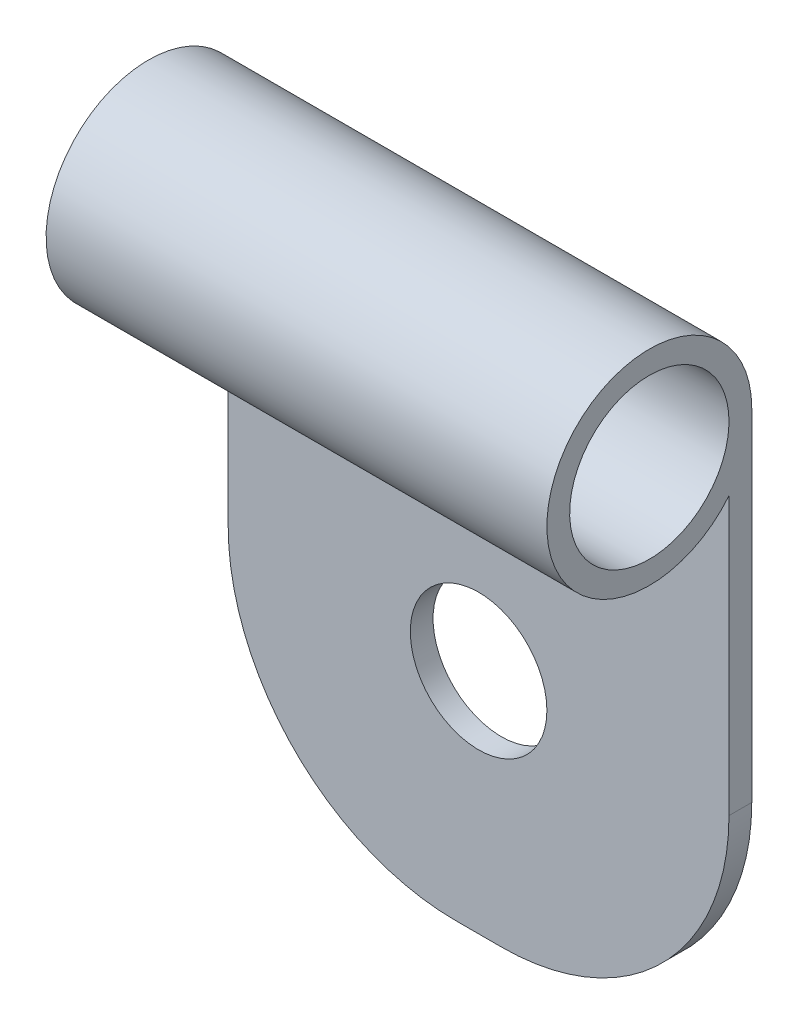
from build123d import *

# Parameters (mm, degrees)
SKETCH1_R      = 3
EXTRUDE1_DEPTH = 1
SKETCH2_R      = 4.5
SKETCH2_R_2    = 3.5
EXTRUDE2_DEPTH = 22


with BuildPart() as part:
    # Sketch1 → Extrude1 (new body)
    with BuildSketch(Plane.XY):
        with BuildLine():
            Line((-1, -10), (1, -10))
            ThreePointArc((1, -10), (8.071067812, -7.071067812), (11, 0))
            Line((11, 0), (11, 15))
            Line((11, 15), (-11, 15))
            Line((-11, 15), (-11, 0))
            ThreePointArc((-11, 0), (-8.071067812, -7.071067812), (-1, -10))
        make_face()
        Circle(SKETCH1_R, mode=Mode.SUBTRACT)
    extrude(amount=EXTRUDE1_DEPTH)

    # Sketch2 → Extrude2 (add, through all)
    with BuildSketch(Plane(origin=(11, 0, 0), x_dir=(0, 0, -1), z_dir=(1, 0, 0))):
        with Locations((-4.5, 15)):
            Circle(SKETCH2_R)
        with Locations(Location((-4.5, 15, 0), (0, 0, 90))):
            Circle(SKETCH2_R_2, mode=Mode.SUBTRACT)
    extrude(amount=-EXTRUDE2_DEPTH)


solid = part.part
